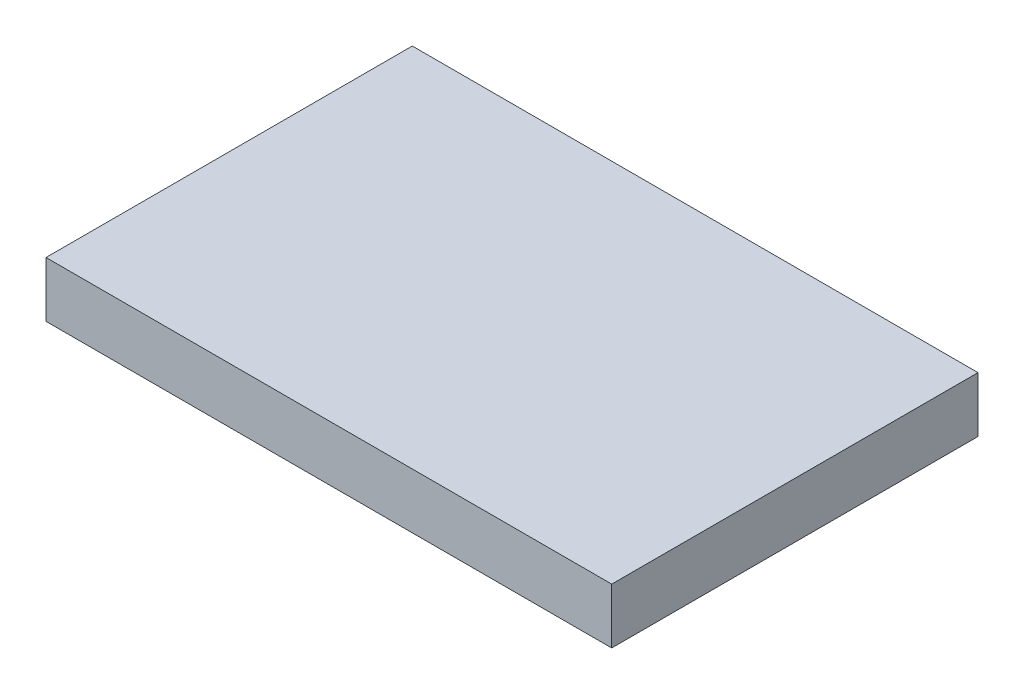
ISO-10303-21;
HEADER;
FILE_DESCRIPTION(('STEP AP214'),'2;1');
FILE_NAME('part.step','',(''),(''),'','','');
FILE_SCHEMA(('AUTOMOTIVE_DESIGN { 1 0 10303 214 1 1 1 1 }'));
ENDSEC;
DATA;
#1=APPLICATION_CONTEXT('core data for automotive mechanical design processes');
#2=APPLICATION_PROTOCOL_DEFINITION('international standard','automotive_design',2000,#1);
#3=PRODUCT_CONTEXT('',#1,'mechanical');
#4=PRODUCT('Part','Part','',(#3));
#5=PRODUCT_RELATED_PRODUCT_CATEGORY('part','',(#4));
#6=PRODUCT_DEFINITION_FORMATION('','',#4);
#7=PRODUCT_DEFINITION_CONTEXT('part definition',#1,'design');
#8=PRODUCT_DEFINITION('design','',#6,#7);
#9=PRODUCT_DEFINITION_SHAPE('','',#8);
#10=(LENGTH_UNIT() NAMED_UNIT(*) SI_UNIT(.MILLI.,.METRE.));
#11=(NAMED_UNIT(*) PLANE_ANGLE_UNIT() SI_UNIT($,.RADIAN.));
#12=(NAMED_UNIT(*) SI_UNIT($,.STERADIAN.) SOLID_ANGLE_UNIT());
#13=UNCERTAINTY_MEASURE_WITH_UNIT(LENGTH_MEASURE(1.E-05),#10,'distance_accuracy_value','');
#14=(GEOMETRIC_REPRESENTATION_CONTEXT(3) GLOBAL_UNCERTAINTY_ASSIGNED_CONTEXT((#13)) GLOBAL_UNIT_ASSIGNED_CONTEXT((#10,
#11,#12)) REPRESENTATION_CONTEXT('',''));
#15=CARTESIAN_POINT('',(0.,0.,0.));
#16=DIRECTION('',(0.,0.,1.));
#17=DIRECTION('',(1.,0.,0.));
#18=AXIS2_PLACEMENT_3D('',#15,#16,#17);
#19=CARTESIAN_POINT('',(-63.6296810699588,12.446,-41.1990740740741));
#20=DIRECTION('',(1.,0.,0.));
#21=DIRECTION('',(0.,0.,-1.));
#22=AXIS2_PLACEMENT_3D('',#19,#20,#21);
#23=PLANE('',#22);
#24=DIRECTION('',(0.,0.,1.));
#25=VECTOR('',#24,1.);
#26=CARTESIAN_POINT('',(-63.6296810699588,0.,-41.1990740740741));
#27=LINE('',#26,#25);
#28=CARTESIAN_POINT('',(-63.6296810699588,0.,-41.1990740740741));
#29=VERTEX_POINT('',#28);
#30=CARTESIAN_POINT('',(-63.6296810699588,0.,41.1990740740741));
#31=VERTEX_POINT('',#30);
#32=EDGE_CURVE('E75',#29,#31,#27,.T.);
#33=ORIENTED_EDGE('',*,*,#32,.T.);
#34=DIRECTION('',(0.,-1.,0.));
#35=VECTOR('',#34,1.);
#36=CARTESIAN_POINT('',(-63.6296810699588,12.446,41.1990740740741));
#37=LINE('',#36,#35);
#38=CARTESIAN_POINT('',(-63.6296810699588,12.446,41.1990740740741));
#39=VERTEX_POINT('',#38);
#40=EDGE_CURVE('E11',#39,#31,#37,.T.);
#41=ORIENTED_EDGE('',*,*,#40,.F.);
#42=DIRECTION('',(0.,0.,1.));
#43=VECTOR('',#42,1.);
#44=CARTESIAN_POINT('',(-63.6296810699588,12.446,-41.1990740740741));
#45=LINE('',#44,#43);
#46=CARTESIAN_POINT('',(-63.6296810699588,12.446,-41.1990740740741));
#47=VERTEX_POINT('',#46);
#48=EDGE_CURVE('E93',#47,#39,#45,.T.);
#49=ORIENTED_EDGE('',*,*,#48,.F.);
#50=DIRECTION('',(0.,-1.,0.));
#51=VECTOR('',#50,1.);
#52=CARTESIAN_POINT('',(-63.6296810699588,12.446,-41.1990740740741));
#53=LINE('',#52,#51);
#54=EDGE_CURVE('E87',#47,#29,#53,.T.);
#55=ORIENTED_EDGE('',*,*,#54,.T.);
#56=EDGE_LOOP('',(#33,#41,#49,#55));
#57=FACE_BOUND('',#56,.T.);
#58=ADVANCED_FACE('F31',(#57),#23,.F.);
#59=CARTESIAN_POINT('',(-63.6296810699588,12.446,41.1990740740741));
#60=DIRECTION('',(0.,0.,-1.));
#61=DIRECTION('',(-1.,0.,0.));
#62=AXIS2_PLACEMENT_3D('',#59,#60,#61);
#63=PLANE('',#62);
#64=DIRECTION('',(1.,0.,0.));
#65=VECTOR('',#64,1.);
#66=CARTESIAN_POINT('',(-63.6296810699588,0.,41.1990740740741));
#67=LINE('',#66,#65);
#68=CARTESIAN_POINT('',(63.6296810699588,0.,41.1990740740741));
#69=VERTEX_POINT('',#68);
#70=EDGE_CURVE('E71',#31,#69,#67,.T.);
#71=ORIENTED_EDGE('',*,*,#70,.T.);
#72=DIRECTION('',(0.,-1.,0.));
#73=VECTOR('',#72,1.);
#74=CARTESIAN_POINT('',(63.6296810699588,12.446,41.1990740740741));
#75=LINE('',#74,#73);
#76=CARTESIAN_POINT('',(63.6296810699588,12.446,41.1990740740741));
#77=VERTEX_POINT('',#76);
#78=EDGE_CURVE('E38',#77,#69,#75,.T.);
#79=ORIENTED_EDGE('',*,*,#78,.F.);
#80=DIRECTION('',(1.,0.,0.));
#81=VECTOR('',#80,1.);
#82=CARTESIAN_POINT('',(-63.6296810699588,12.446,41.1990740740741));
#83=LINE('',#82,#81);
#84=EDGE_CURVE('E83',#39,#77,#83,.T.);
#85=ORIENTED_EDGE('',*,*,#84,.F.);
#86=ORIENTED_EDGE('',*,*,#40,.T.);
#87=EDGE_LOOP('',(#71,#79,#85,#86));
#88=FACE_BOUND('',#87,.T.);
#89=ADVANCED_FACE('F82',(#88),#63,.F.);
#90=CARTESIAN_POINT('',(63.6296810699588,12.446,-41.1990740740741));
#91=DIRECTION('',(-1.,0.,0.));
#92=DIRECTION('',(0.,0.,1.));
#93=AXIS2_PLACEMENT_3D('',#90,#91,#92);
#94=PLANE('',#93);
#95=DIRECTION('',(0.,0.,-1.));
#96=VECTOR('',#95,1.);
#97=CARTESIAN_POINT('',(63.6296810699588,0.,-41.1990740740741));
#98=LINE('',#97,#96);
#99=CARTESIAN_POINT('',(63.6296810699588,0.,-41.1990740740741));
#100=VERTEX_POINT('',#99);
#101=EDGE_CURVE('E76',#69,#100,#98,.T.);
#102=ORIENTED_EDGE('',*,*,#101,.T.);
#103=DIRECTION('',(0.,-1.,0.));
#104=VECTOR('',#103,1.);
#105=CARTESIAN_POINT('',(63.6296810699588,12.446,-41.1990740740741));
#106=LINE('',#105,#104);
#107=CARTESIAN_POINT('',(63.6296810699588,12.446,-41.1990740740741));
#108=VERTEX_POINT('',#107);
#109=EDGE_CURVE('E99',#108,#100,#106,.T.);
#110=ORIENTED_EDGE('',*,*,#109,.F.);
#111=DIRECTION('',(0.,0.,-1.));
#112=VECTOR('',#111,1.);
#113=CARTESIAN_POINT('',(63.6296810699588,12.446,-41.1990740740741));
#114=LINE('',#113,#112);
#115=EDGE_CURVE('E50',#77,#108,#114,.T.);
#116=ORIENTED_EDGE('',*,*,#115,.F.);
#117=ORIENTED_EDGE('',*,*,#78,.T.);
#118=EDGE_LOOP('',(#102,#110,#116,#117));
#119=FACE_BOUND('',#118,.T.);
#120=ADVANCED_FACE('F102',(#119),#94,.F.);
#121=CARTESIAN_POINT('',(-63.6296810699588,12.446,-41.1990740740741));
#122=DIRECTION('',(0.,0.,1.));
#123=DIRECTION('',(1.,0.,0.));
#124=AXIS2_PLACEMENT_3D('',#121,#122,#123);
#125=PLANE('',#124);
#126=DIRECTION('',(-1.,0.,0.));
#127=VECTOR('',#126,1.);
#128=CARTESIAN_POINT('',(-63.6296810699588,0.,-41.1990740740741));
#129=LINE('',#128,#127);
#130=EDGE_CURVE('E91',#100,#29,#129,.T.);
#131=ORIENTED_EDGE('',*,*,#130,.T.);
#132=ORIENTED_EDGE('',*,*,#54,.F.);
#133=DIRECTION('',(-1.,0.,0.));
#134=VECTOR('',#133,1.);
#135=CARTESIAN_POINT('',(-63.6296810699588,12.446,-41.1990740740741));
#136=LINE('',#135,#134);
#137=EDGE_CURVE('E45',#108,#47,#136,.T.);
#138=ORIENTED_EDGE('',*,*,#137,.F.);
#139=ORIENTED_EDGE('',*,*,#109,.T.);
#140=EDGE_LOOP('',(#131,#132,#138,#139));
#141=FACE_BOUND('',#140,.T.);
#142=ADVANCED_FACE('F104',(#141),#125,.F.);
#143=CARTESIAN_POINT('',(-63.6296810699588,12.446,41.1990740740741));
#144=DIRECTION('',(0.,1.,0.));
#145=DIRECTION('',(0.,0.,1.));
#146=AXIS2_PLACEMENT_3D('',#143,#144,#145);
#147=PLANE('',#146);
#148=ORIENTED_EDGE('',*,*,#48,.T.);
#149=ORIENTED_EDGE('',*,*,#84,.T.);
#150=ORIENTED_EDGE('',*,*,#115,.T.);
#151=ORIENTED_EDGE('',*,*,#137,.T.);
#152=EDGE_LOOP('',(#148,#149,#150,#151));
#153=FACE_BOUND('',#152,.T.);
#154=ADVANCED_FACE('F105',(#153),#147,.T.);
#155=CARTESIAN_POINT('',(-63.6296810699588,0.,41.1990740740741));
#156=DIRECTION('',(0.,1.,0.));
#157=DIRECTION('',(0.,0.,1.));
#158=AXIS2_PLACEMENT_3D('',#155,#156,#157);
#159=PLANE('',#158);
#160=ORIENTED_EDGE('',*,*,#32,.F.);
#161=ORIENTED_EDGE('',*,*,#130,.F.);
#162=ORIENTED_EDGE('',*,*,#101,.F.);
#163=ORIENTED_EDGE('',*,*,#70,.F.);
#164=EDGE_LOOP('',(#160,#161,#162,#163));
#165=FACE_BOUND('',#164,.T.);
#166=ADVANCED_FACE('F72',(#165),#159,.F.);
#167=CLOSED_SHELL('',(#58,#89,#120,#142,#154,#166));
#168=MANIFOLD_SOLID_BREP('B2',#167);
#169=ADVANCED_BREP_SHAPE_REPRESENTATION('',(#18,#168),#14);
#170=SHAPE_DEFINITION_REPRESENTATION(#9,#169);
ENDSEC;
END-ISO-10303-21;
